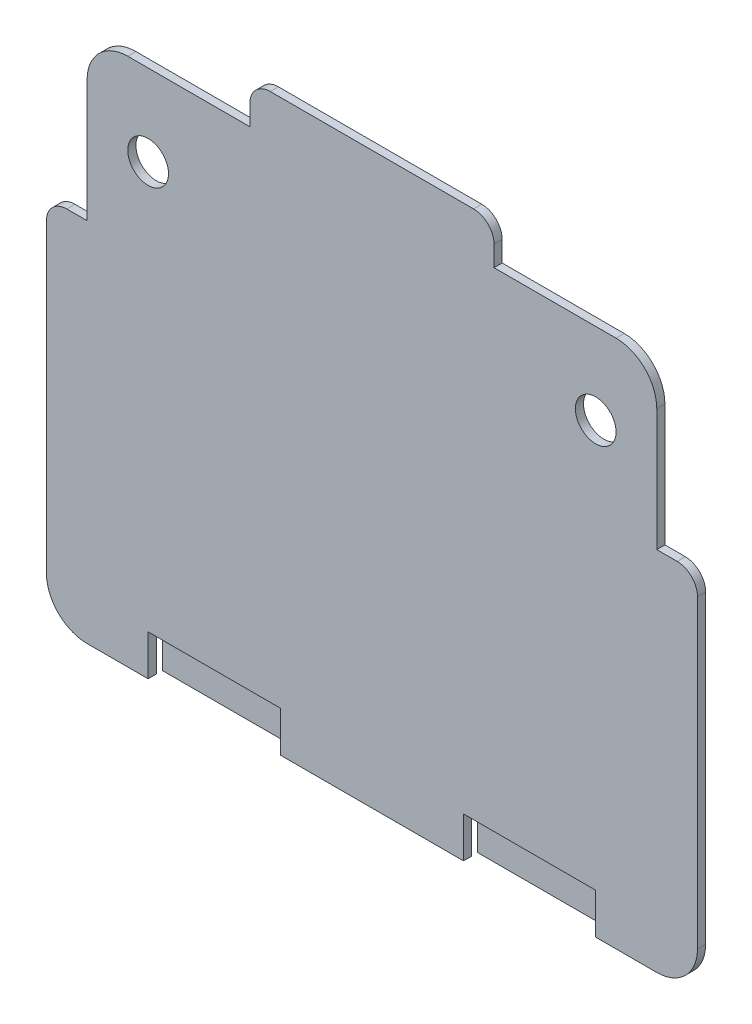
ISO-10303-21;
HEADER;
FILE_DESCRIPTION(('STEP AP214'),'2;1');
FILE_NAME('part.step','',(''),(''),'','','');
FILE_SCHEMA(('AUTOMOTIVE_DESIGN { 1 0 10303 214 1 1 1 1 }'));
ENDSEC;
DATA;
#1=APPLICATION_CONTEXT('core data for automotive mechanical design processes');
#2=APPLICATION_PROTOCOL_DEFINITION('international standard','automotive_design',2000,#1);
#3=PRODUCT_CONTEXT('',#1,'mechanical');
#4=PRODUCT('Part','Part','',(#3));
#5=PRODUCT_RELATED_PRODUCT_CATEGORY('part','',(#4));
#6=PRODUCT_DEFINITION_FORMATION('','',#4);
#7=PRODUCT_DEFINITION_CONTEXT('part definition',#1,'design');
#8=PRODUCT_DEFINITION('design','',#6,#7);
#9=PRODUCT_DEFINITION_SHAPE('','',#8);
#10=(LENGTH_UNIT() NAMED_UNIT(*) SI_UNIT(.MILLI.,.METRE.));
#11=(NAMED_UNIT(*) PLANE_ANGLE_UNIT() SI_UNIT($,.RADIAN.));
#12=(NAMED_UNIT(*) SI_UNIT($,.STERADIAN.) SOLID_ANGLE_UNIT());
#13=UNCERTAINTY_MEASURE_WITH_UNIT(LENGTH_MEASURE(1.E-05),#10,'distance_accuracy_value','');
#14=(GEOMETRIC_REPRESENTATION_CONTEXT(3) GLOBAL_UNCERTAINTY_ASSIGNED_CONTEXT((#13)) GLOBAL_UNIT_ASSIGNED_CONTEXT((#10,
#11,#12)) REPRESENTATION_CONTEXT('',''));
#15=CARTESIAN_POINT('',(0.,0.,0.));
#16=DIRECTION('',(0.,0.,1.));
#17=DIRECTION('',(1.,0.,0.));
#18=AXIS2_PLACEMENT_3D('',#15,#16,#17);
#19=CARTESIAN_POINT('',(0.,0.,0.));
#20=DIRECTION('',(0.,0.,-1.));
#21=DIRECTION('',(-1.,0.,0.));
#22=AXIS2_PLACEMENT_3D('',#19,#20,#21);
#23=PLANE('',#22);
#24=DIRECTION('',(-1.,0.,0.));
#25=VECTOR('',#24,1.);
#26=CARTESIAN_POINT('',(97.4074074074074,53.5185185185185,0.));
#27=LINE('',#26,#25);
#28=CARTESIAN_POINT('',(92.4074074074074,53.5185185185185,0.));
#29=VERTEX_POINT('',#28);
#30=CARTESIAN_POINT('',(87.4074074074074,53.5185185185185,0.));
#31=VERTEX_POINT('',#30);
#32=EDGE_CURVE('E460',#29,#31,#27,.T.);
#33=ORIENTED_EDGE('',*,*,#32,.F.);
#34=CARTESIAN_POINT('',(92.4074074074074,48.5185185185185,0.));
#35=DIRECTION('',(0.,0.,-1.));
#36=DIRECTION('',(-1.,0.,0.));
#37=AXIS2_PLACEMENT_3D('',#34,#35,#36);
#38=CIRCLE('',#37,5.);
#39=CARTESIAN_POINT('',(97.4074074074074,48.5185185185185,0.));
#40=VERTEX_POINT('',#39);
#41=EDGE_CURVE('E554',#29,#40,#38,.T.);
#42=ORIENTED_EDGE('',*,*,#41,.T.);
#43=DIRECTION('',(0.,1.,0.));
#44=VECTOR('',#43,1.);
#45=CARTESIAN_POINT('',(97.4074074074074,-36.4814814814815,0.));
#46=LINE('',#45,#44);
#47=CARTESIAN_POINT('',(97.4074074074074,-26.4814814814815,0.));
#48=VERTEX_POINT('',#47);
#49=EDGE_CURVE('E457',#48,#40,#46,.T.);
#50=ORIENTED_EDGE('',*,*,#49,.F.);
#51=CARTESIAN_POINT('',(87.4074074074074,-26.4814814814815,0.));
#52=DIRECTION('',(0.,0.,-1.));
#53=DIRECTION('',(-1.,0.,0.));
#54=AXIS2_PLACEMENT_3D('',#51,#52,#53);
#55=CIRCLE('',#54,10.);
#56=CARTESIAN_POINT('',(87.4074074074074,-36.4814814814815,0.));
#57=VERTEX_POINT('',#56);
#58=EDGE_CURVE('E521',#48,#57,#55,.T.);
#59=ORIENTED_EDGE('',*,*,#58,.T.);
#60=DIRECTION('',(1.,0.,0.));
#61=VECTOR('',#60,1.);
#62=CARTESIAN_POINT('',(72.4074074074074,-36.4814814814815,0.));
#63=LINE('',#62,#61);
#64=CARTESIAN_POINT('',(72.4074074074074,-36.4814814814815,0.));
#65=VERTEX_POINT('',#64);
#66=EDGE_CURVE('E454',#65,#57,#63,.T.);
#67=ORIENTED_EDGE('',*,*,#66,.F.);
#68=DIRECTION('',(0.,-1.,0.));
#69=VECTOR('',#68,1.);
#70=CARTESIAN_POINT('',(72.4074074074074,-26.4814814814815,0.));
#71=LINE('',#70,#69);
#72=CARTESIAN_POINT('',(72.4074074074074,-26.4814814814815,0.));
#73=VERTEX_POINT('',#72);
#74=EDGE_CURVE('E452',#73,#65,#71,.T.);
#75=ORIENTED_EDGE('',*,*,#74,.F.);
#76=DIRECTION('',(0.,1.,0.));
#77=VECTOR('',#76,1.);
#78=CARTESIAN_POINT('',(72.4074074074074,0.,0.));
#79=LINE('',#78,#77);
#80=CARTESIAN_POINT('',(72.4074074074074,-25.2814814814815,0.));
#81=VERTEX_POINT('',#80);
#82=EDGE_CURVE('E366',#73,#81,#79,.T.);
#83=ORIENTED_EDGE('',*,*,#82,.T.);
#84=DIRECTION('',(-1.,0.,0.));
#85=VECTOR('',#84,1.);
#86=CARTESIAN_POINT('',(0.,-25.2814814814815,0.));
#87=LINE('',#86,#85);
#88=CARTESIAN_POINT('',(39.9074074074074,-25.2814814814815,0.));
#89=VERTEX_POINT('',#88);
#90=EDGE_CURVE('E369',#81,#89,#87,.T.);
#91=ORIENTED_EDGE('',*,*,#90,.T.);
#92=DIRECTION('',(0.,-1.,0.));
#93=VECTOR('',#92,1.);
#94=CARTESIAN_POINT('',(39.9074074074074,0.,0.));
#95=LINE('',#94,#93);
#96=CARTESIAN_POINT('',(39.9074074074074,-26.4814814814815,0.));
#97=VERTEX_POINT('',#96);
#98=EDGE_CURVE('E361',#89,#97,#95,.T.);
#99=ORIENTED_EDGE('',*,*,#98,.T.);
#100=DIRECTION('',(0.,1.,0.));
#101=VECTOR('',#100,1.);
#102=CARTESIAN_POINT('',(39.9074074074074,-36.4814814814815,0.));
#103=LINE('',#102,#101);
#104=CARTESIAN_POINT('',(39.9074074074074,-36.4814814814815,0.));
#105=VERTEX_POINT('',#104);
#106=EDGE_CURVE('E449',#105,#97,#103,.T.);
#107=ORIENTED_EDGE('',*,*,#106,.F.);
#108=DIRECTION('',(1.,0.,0.));
#109=VECTOR('',#108,1.);
#110=CARTESIAN_POINT('',(-5.09259259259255,-36.4814814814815,0.));
#111=LINE('',#110,#109);
#112=CARTESIAN_POINT('',(-5.09259259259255,-36.4814814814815,0.));
#113=VERTEX_POINT('',#112);
#114=EDGE_CURVE('E447',#113,#105,#111,.T.);
#115=ORIENTED_EDGE('',*,*,#114,.F.);
#116=DIRECTION('',(0.,-1.,0.));
#117=VECTOR('',#116,1.);
#118=CARTESIAN_POINT('',(-5.09259259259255,-36.4814814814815,0.));
#119=LINE('',#118,#117);
#120=CARTESIAN_POINT('',(-5.09259259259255,-26.4814814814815,0.));
#121=VERTEX_POINT('',#120);
#122=EDGE_CURVE('E445',#121,#113,#119,.T.);
#123=ORIENTED_EDGE('',*,*,#122,.F.);
#124=DIRECTION('',(0.,1.,0.));
#125=VECTOR('',#124,1.);
#126=CARTESIAN_POINT('',(-5.09259259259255,0.,0.));
#127=LINE('',#126,#125);
#128=CARTESIAN_POINT('',(-5.09259259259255,-25.2814814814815,0.));
#129=VERTEX_POINT('',#128);
#130=EDGE_CURVE('E345',#121,#129,#127,.T.);
#131=ORIENTED_EDGE('',*,*,#130,.T.);
#132=DIRECTION('',(-1.,0.,0.));
#133=VECTOR('',#132,1.);
#134=CARTESIAN_POINT('',(0.,-25.2814814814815,0.));
#135=LINE('',#134,#133);
#136=CARTESIAN_POINT('',(-37.5925925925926,-25.2814814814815,0.));
#137=VERTEX_POINT('',#136);
#138=EDGE_CURVE('E348',#129,#137,#135,.T.);
#139=ORIENTED_EDGE('',*,*,#138,.T.);
#140=DIRECTION('',(0.,-1.,0.));
#141=VECTOR('',#140,1.);
#142=CARTESIAN_POINT('',(-37.5925925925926,0.,0.));
#143=LINE('',#142,#141);
#144=CARTESIAN_POINT('',(-37.5925925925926,-26.4814814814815,0.));
#145=VERTEX_POINT('',#144);
#146=EDGE_CURVE('E340',#137,#145,#143,.T.);
#147=ORIENTED_EDGE('',*,*,#146,.T.);
#148=DIRECTION('',(0.,1.,0.));
#149=VECTOR('',#148,1.);
#150=CARTESIAN_POINT('',(-37.5925925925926,-26.4814814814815,0.));
#151=LINE('',#150,#149);
#152=CARTESIAN_POINT('',(-37.5925925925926,-36.4814814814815,0.));
#153=VERTEX_POINT('',#152);
#154=EDGE_CURVE('E442',#153,#145,#151,.T.);
#155=ORIENTED_EDGE('',*,*,#154,.F.);
#156=DIRECTION('',(1.,0.,0.));
#157=VECTOR('',#156,1.);
#158=CARTESIAN_POINT('',(-37.5925925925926,-36.4814814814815,0.));
#159=LINE('',#158,#157);
#160=CARTESIAN_POINT('',(-52.5925925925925,-36.4814814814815,0.));
#161=VERTEX_POINT('',#160);
#162=EDGE_CURVE('E440',#161,#153,#159,.T.);
#163=ORIENTED_EDGE('',*,*,#162,.F.);
#164=CARTESIAN_POINT('',(-52.5925925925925,-26.4814814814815,0.));
#165=DIRECTION('',(0.,0.,-1.));
#166=DIRECTION('',(-1.,0.,0.));
#167=AXIS2_PLACEMENT_3D('',#164,#165,#166);
#168=CIRCLE('',#167,10.);
#169=CARTESIAN_POINT('',(-62.5925925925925,-26.4814814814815,0.));
#170=VERTEX_POINT('',#169);
#171=EDGE_CURVE('E523',#161,#170,#168,.T.);
#172=ORIENTED_EDGE('',*,*,#171,.T.);
#173=DIRECTION('',(0.,-1.,0.));
#174=VECTOR('',#173,1.);
#175=CARTESIAN_POINT('',(-62.5925925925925,-36.4814814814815,0.));
#176=LINE('',#175,#174);
#177=CARTESIAN_POINT('',(-62.5925925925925,48.5185185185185,0.));
#178=VERTEX_POINT('',#177);
#179=EDGE_CURVE('E438',#178,#170,#176,.T.);
#180=ORIENTED_EDGE('',*,*,#179,.F.);
#181=CARTESIAN_POINT('',(-57.5925925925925,48.5185185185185,0.));
#182=DIRECTION('',(0.,0.,-1.));
#183=DIRECTION('',(-1.,0.,0.));
#184=AXIS2_PLACEMENT_3D('',#181,#182,#183);
#185=CIRCLE('',#184,5.);
#186=CARTESIAN_POINT('',(-57.5925925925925,53.5185185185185,0.));
#187=VERTEX_POINT('',#186);
#188=EDGE_CURVE('E548',#178,#187,#185,.T.);
#189=ORIENTED_EDGE('',*,*,#188,.T.);
#190=DIRECTION('',(-1.,0.,0.));
#191=VECTOR('',#190,1.);
#192=CARTESIAN_POINT('',(-62.5925925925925,53.5185185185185,0.));
#193=LINE('',#192,#191);
#194=CARTESIAN_POINT('',(-52.5925925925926,53.5185185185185,0.));
#195=VERTEX_POINT('',#194);
#196=EDGE_CURVE('E436',#195,#187,#193,.T.);
#197=ORIENTED_EDGE('',*,*,#196,.F.);
#198=DIRECTION('',(0.,-1.,0.));
#199=VECTOR('',#198,1.);
#200=CARTESIAN_POINT('',(-52.5925925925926,53.5185185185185,0.));
#201=LINE('',#200,#199);
#202=CARTESIAN_POINT('',(-52.5925925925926,83.5185185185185,0.));
#203=VERTEX_POINT('',#202);
#204=EDGE_CURVE('E434',#203,#195,#201,.T.);
#205=ORIENTED_EDGE('',*,*,#204,.F.);
#206=CARTESIAN_POINT('',(-42.5925925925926,83.5185185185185,0.));
#207=DIRECTION('',(0.,0.,-1.));
#208=DIRECTION('',(-1.,0.,0.));
#209=AXIS2_PLACEMENT_3D('',#206,#207,#208);
#210=CIRCLE('',#209,10.);
#211=CARTESIAN_POINT('',(-42.5925925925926,93.5185185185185,0.));
#212=VERTEX_POINT('',#211);
#213=EDGE_CURVE('E510',#203,#212,#210,.T.);
#214=ORIENTED_EDGE('',*,*,#213,.T.);
#215=DIRECTION('',(-1.,0.,0.));
#216=VECTOR('',#215,1.);
#217=CARTESIAN_POINT('',(-52.5925925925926,93.5185185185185,0.));
#218=LINE('',#217,#216);
#219=CARTESIAN_POINT('',(-12.5925925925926,93.5185185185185,0.));
#220=VERTEX_POINT('',#219);
#221=EDGE_CURVE('E431',#220,#212,#218,.T.);
#222=ORIENTED_EDGE('',*,*,#221,.F.);
#223=DIRECTION('',(0.,-1.,0.));
#224=VECTOR('',#223,1.);
#225=CARTESIAN_POINT('',(-12.5925925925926,93.5185185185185,0.));
#226=LINE('',#225,#224);
#227=CARTESIAN_POINT('',(-12.5925925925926,98.5185185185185,0.));
#228=VERTEX_POINT('',#227);
#229=EDGE_CURVE('E382',#228,#220,#226,.T.);
#230=ORIENTED_EDGE('',*,*,#229,.F.);
#231=CARTESIAN_POINT('',(-7.59259259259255,98.5185185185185,0.));
#232=DIRECTION('',(0.,0.,-1.));
#233=DIRECTION('',(-1.,0.,0.));
#234=AXIS2_PLACEMENT_3D('',#231,#232,#233);
#235=CIRCLE('',#234,5.);
#236=CARTESIAN_POINT('',(-7.59259259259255,103.518518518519,0.));
#237=VERTEX_POINT('',#236);
#238=EDGE_CURVE('E550',#228,#237,#235,.T.);
#239=ORIENTED_EDGE('',*,*,#238,.T.);
#240=DIRECTION('',(-1.,0.,0.));
#241=VECTOR('',#240,1.);
#242=CARTESIAN_POINT('',(-12.5925925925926,103.518518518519,0.));
#243=LINE('',#242,#241);
#244=CARTESIAN_POINT('',(42.4074074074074,103.518518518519,0.));
#245=VERTEX_POINT('',#244);
#246=EDGE_CURVE('E386',#245,#237,#243,.T.);
#247=ORIENTED_EDGE('',*,*,#246,.F.);
#248=CARTESIAN_POINT('',(42.4074074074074,98.5185185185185,0.));
#249=DIRECTION('',(0.,0.,-1.));
#250=DIRECTION('',(-1.,0.,0.));
#251=AXIS2_PLACEMENT_3D('',#248,#249,#250);
#252=CIRCLE('',#251,5.);
#253=CARTESIAN_POINT('',(47.4074074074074,98.5185185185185,0.));
#254=VERTEX_POINT('',#253);
#255=EDGE_CURVE('E552',#245,#254,#252,.T.);
#256=ORIENTED_EDGE('',*,*,#255,.T.);
#257=DIRECTION('',(0.,1.,0.));
#258=VECTOR('',#257,1.);
#259=CARTESIAN_POINT('',(47.4074074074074,93.5185185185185,0.));
#260=LINE('',#259,#258);
#261=CARTESIAN_POINT('',(47.4074074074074,93.5185185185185,0.));
#262=VERTEX_POINT('',#261);
#263=EDGE_CURVE('E467',#262,#254,#260,.T.);
#264=ORIENTED_EDGE('',*,*,#263,.F.);
#265=DIRECTION('',(-1.,0.,0.));
#266=VECTOR('',#265,1.);
#267=CARTESIAN_POINT('',(87.4074074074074,93.5185185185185,0.));
#268=LINE('',#267,#266);
#269=CARTESIAN_POINT('',(77.4074074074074,93.5185185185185,0.));
#270=VERTEX_POINT('',#269);
#271=EDGE_CURVE('E465',#270,#262,#268,.T.);
#272=ORIENTED_EDGE('',*,*,#271,.F.);
#273=CARTESIAN_POINT('',(77.4074074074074,83.5185185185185,0.));
#274=DIRECTION('',(0.,0.,-1.));
#275=DIRECTION('',(-1.,0.,0.));
#276=AXIS2_PLACEMENT_3D('',#273,#274,#275);
#277=CIRCLE('',#276,10.);
#278=CARTESIAN_POINT('',(87.4074074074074,83.5185185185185,0.));
#279=VERTEX_POINT('',#278);
#280=EDGE_CURVE('E519',#270,#279,#277,.T.);
#281=ORIENTED_EDGE('',*,*,#280,.T.);
#282=DIRECTION('',(0.,1.,0.));
#283=VECTOR('',#282,1.);
#284=CARTESIAN_POINT('',(87.4074074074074,53.5185185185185,0.));
#285=LINE('',#284,#283);
#286=EDGE_CURVE('E462',#31,#279,#285,.T.);
#287=ORIENTED_EDGE('',*,*,#286,.F.);
#288=EDGE_LOOP('',(#33,#42,#50,#59,#67,#75,#83,#91,#99,#107,#115,#123,#131,#139,#147,#155,#163,
#172,#180,#189,#197,#205,#214,#222,#230,#239,#247,#256,#264,#272,#281,#287));
#289=FACE_BOUND('',#288,.T.);
#290=CARTESIAN_POINT('',(72.4074074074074,73.5185185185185,0.));
#291=DIRECTION('',(0.,0.,-1.));
#292=DIRECTION('',(-1.,0.,0.));
#293=AXIS2_PLACEMENT_3D('',#290,#291,#292);
#294=CIRCLE('',#293,5.00000000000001);
#295=CARTESIAN_POINT('',(67.4074074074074,73.5185185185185,0.));
#296=VERTEX_POINT('',#295);
#297=EDGE_CURVE('E1164',#296,#296,#294,.T.);
#298=ORIENTED_EDGE('',*,*,#297,.F.);
#299=EDGE_LOOP('',(#298));
#300=FACE_BOUND('',#299,.T.);
#301=CARTESIAN_POINT('',(-37.5925925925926,73.5185185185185,0.));
#302=DIRECTION('',(0.,0.,-1.));
#303=DIRECTION('',(-1.,0.,0.));
#304=AXIS2_PLACEMENT_3D('',#301,#302,#303);
#305=CIRCLE('',#304,5.00000000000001);
#306=CARTESIAN_POINT('',(-42.5925925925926,73.5185185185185,0.));
#307=VERTEX_POINT('',#306);
#308=EDGE_CURVE('E1161',#307,#307,#305,.F.);
#309=ORIENTED_EDGE('',*,*,#308,.T.);
#310=EDGE_LOOP('',(#309));
#311=FACE_BOUND('',#310,.T.);
#312=ADVANCED_FACE('F40',(#289,#300,#311),#23,.T.);
#313=CARTESIAN_POINT('',(0.,0.,2.));
#314=DIRECTION('',(0.,0.,-1.));
#315=DIRECTION('',(-1.,0.,0.));
#316=AXIS2_PLACEMENT_3D('',#313,#314,#315);
#317=PLANE('',#316);
#318=CARTESIAN_POINT('',(72.4074074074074,73.5185185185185,2.));
#319=DIRECTION('',(0.,0.,1.));
#320=DIRECTION('',(1.,0.,0.));
#321=AXIS2_PLACEMENT_3D('',#318,#319,#320);
#322=CIRCLE('',#321,5.00000000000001);
#323=CARTESIAN_POINT('',(77.4074074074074,73.5185185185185,2.));
#324=VERTEX_POINT('',#323);
#325=EDGE_CURVE('E1172',#324,#324,#322,.T.);
#326=ORIENTED_EDGE('',*,*,#325,.F.);
#327=EDGE_LOOP('',(#326));
#328=FACE_BOUND('',#327,.T.);
#329=DIRECTION('',(0.,1.,0.));
#330=VECTOR('',#329,1.);
#331=CARTESIAN_POINT('',(97.4074074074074,-36.4814814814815,2.));
#332=LINE('',#331,#330);
#333=CARTESIAN_POINT('',(97.4074074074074,-26.4814814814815,2.));
#334=VERTEX_POINT('',#333);
#335=CARTESIAN_POINT('',(97.4074074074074,48.5185185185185,2.));
#336=VERTEX_POINT('',#335);
#337=EDGE_CURVE('E414',#334,#336,#332,.T.);
#338=ORIENTED_EDGE('',*,*,#337,.T.);
#339=CARTESIAN_POINT('',(92.4074074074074,48.5185185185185,2.));
#340=DIRECTION('',(0.,0.,-1.));
#341=DIRECTION('',(-1.,0.,0.));
#342=AXIS2_PLACEMENT_3D('',#339,#340,#341);
#343=CIRCLE('',#342,5.);
#344=CARTESIAN_POINT('',(92.4074074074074,53.5185185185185,2.));
#345=VERTEX_POINT('',#344);
#346=EDGE_CURVE('E563',#336,#345,#343,.F.);
#347=ORIENTED_EDGE('',*,*,#346,.T.);
#348=DIRECTION('',(-1.,0.,0.));
#349=VECTOR('',#348,1.);
#350=CARTESIAN_POINT('',(97.4074074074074,53.5185185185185,2.));
#351=LINE('',#350,#349);
#352=CARTESIAN_POINT('',(87.4074074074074,53.5185185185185,2.));
#353=VERTEX_POINT('',#352);
#354=EDGE_CURVE('E417',#345,#353,#351,.T.);
#355=ORIENTED_EDGE('',*,*,#354,.T.);
#356=DIRECTION('',(0.,1.,0.));
#357=VECTOR('',#356,1.);
#358=CARTESIAN_POINT('',(87.4074074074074,53.5185185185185,2.));
#359=LINE('',#358,#357);
#360=CARTESIAN_POINT('',(87.4074074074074,83.5185185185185,2.));
#361=VERTEX_POINT('',#360);
#362=EDGE_CURVE('E419',#353,#361,#359,.T.);
#363=ORIENTED_EDGE('',*,*,#362,.T.);
#364=CARTESIAN_POINT('',(77.4074074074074,83.5185185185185,2.));
#365=DIRECTION('',(0.,0.,-1.));
#366=DIRECTION('',(-1.,0.,0.));
#367=AXIS2_PLACEMENT_3D('',#364,#365,#366);
#368=CIRCLE('',#367,10.);
#369=CARTESIAN_POINT('',(77.4074074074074,93.5185185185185,2.));
#370=VERTEX_POINT('',#369);
#371=EDGE_CURVE('E529',#361,#370,#368,.F.);
#372=ORIENTED_EDGE('',*,*,#371,.T.);
#373=DIRECTION('',(-1.,0.,0.));
#374=VECTOR('',#373,1.);
#375=CARTESIAN_POINT('',(87.4074074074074,93.5185185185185,2.));
#376=LINE('',#375,#374);
#377=CARTESIAN_POINT('',(47.4074074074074,93.5185185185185,2.));
#378=VERTEX_POINT('',#377);
#379=EDGE_CURVE('E422',#370,#378,#376,.T.);
#380=ORIENTED_EDGE('',*,*,#379,.T.);
#381=DIRECTION('',(0.,1.,0.));
#382=VECTOR('',#381,1.);
#383=CARTESIAN_POINT('',(47.4074074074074,93.5185185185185,2.));
#384=LINE('',#383,#382);
#385=CARTESIAN_POINT('',(47.4074074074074,98.5185185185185,2.));
#386=VERTEX_POINT('',#385);
#387=EDGE_CURVE('E424',#378,#386,#384,.T.);
#388=ORIENTED_EDGE('',*,*,#387,.T.);
#389=CARTESIAN_POINT('',(42.4074074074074,98.5185185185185,2.));
#390=DIRECTION('',(0.,0.,-1.));
#391=DIRECTION('',(-1.,0.,0.));
#392=AXIS2_PLACEMENT_3D('',#389,#390,#391);
#393=CIRCLE('',#392,5.);
#394=CARTESIAN_POINT('',(42.4074074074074,103.518518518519,2.));
#395=VERTEX_POINT('',#394);
#396=EDGE_CURVE('E561',#386,#395,#393,.F.);
#397=ORIENTED_EDGE('',*,*,#396,.T.);
#398=DIRECTION('',(-1.,0.,0.));
#399=VECTOR('',#398,1.);
#400=CARTESIAN_POINT('',(-12.5925925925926,103.518518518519,2.));
#401=LINE('',#400,#399);
#402=CARTESIAN_POINT('',(-7.59259259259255,103.518518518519,2.));
#403=VERTEX_POINT('',#402);
#404=EDGE_CURVE('E427',#395,#403,#401,.T.);
#405=ORIENTED_EDGE('',*,*,#404,.T.);
#406=CARTESIAN_POINT('',(-7.59259259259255,98.5185185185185,2.));
#407=DIRECTION('',(0.,0.,-1.));
#408=DIRECTION('',(-1.,0.,0.));
#409=AXIS2_PLACEMENT_3D('',#406,#407,#408);
#410=CIRCLE('',#409,5.);
#411=CARTESIAN_POINT('',(-12.5925925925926,98.5185185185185,2.));
#412=VERTEX_POINT('',#411);
#413=EDGE_CURVE('E61',#403,#412,#410,.F.);
#414=ORIENTED_EDGE('',*,*,#413,.T.);
#415=DIRECTION('',(0.,-1.,0.));
#416=VECTOR('',#415,1.);
#417=CARTESIAN_POINT('',(-12.5925925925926,93.5185185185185,2.));
#418=LINE('',#417,#416);
#419=CARTESIAN_POINT('',(-12.5925925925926,93.5185185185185,2.));
#420=VERTEX_POINT('',#419);
#421=EDGE_CURVE('E383',#412,#420,#418,.T.);
#422=ORIENTED_EDGE('',*,*,#421,.T.);
#423=DIRECTION('',(-1.,0.,0.));
#424=VECTOR('',#423,1.);
#425=CARTESIAN_POINT('',(-52.5925925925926,93.5185185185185,2.));
#426=LINE('',#425,#424);
#427=CARTESIAN_POINT('',(-42.5925925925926,93.5185185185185,2.));
#428=VERTEX_POINT('',#427);
#429=EDGE_CURVE('E385',#420,#428,#426,.T.);
#430=ORIENTED_EDGE('',*,*,#429,.T.);
#431=CARTESIAN_POINT('',(-42.5925925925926,83.5185185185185,2.));
#432=DIRECTION('',(0.,0.,-1.));
#433=DIRECTION('',(-1.,0.,0.));
#434=AXIS2_PLACEMENT_3D('',#431,#432,#433);
#435=CIRCLE('',#434,10.);
#436=CARTESIAN_POINT('',(-52.5925925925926,83.5185185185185,2.));
#437=VERTEX_POINT('',#436);
#438=EDGE_CURVE('E514',#428,#437,#435,.F.);
#439=ORIENTED_EDGE('',*,*,#438,.T.);
#440=DIRECTION('',(0.,-1.,0.));
#441=VECTOR('',#440,1.);
#442=CARTESIAN_POINT('',(-52.5925925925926,53.5185185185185,2.));
#443=LINE('',#442,#441);
#444=CARTESIAN_POINT('',(-52.5925925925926,53.5185185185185,2.));
#445=VERTEX_POINT('',#444);
#446=EDGE_CURVE('E389',#437,#445,#443,.T.);
#447=ORIENTED_EDGE('',*,*,#446,.T.);
#448=DIRECTION('',(-1.,0.,0.));
#449=VECTOR('',#448,1.);
#450=CARTESIAN_POINT('',(-62.5925925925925,53.5185185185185,2.));
#451=LINE('',#450,#449);
#452=CARTESIAN_POINT('',(-57.5925925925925,53.5185185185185,2.));
#453=VERTEX_POINT('',#452);
#454=EDGE_CURVE('E391',#445,#453,#451,.T.);
#455=ORIENTED_EDGE('',*,*,#454,.T.);
#456=CARTESIAN_POINT('',(-57.5925925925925,48.5185185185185,2.));
#457=DIRECTION('',(0.,0.,-1.));
#458=DIRECTION('',(-1.,0.,0.));
#459=AXIS2_PLACEMENT_3D('',#456,#457,#458);
#460=CIRCLE('',#459,5.);
#461=CARTESIAN_POINT('',(-62.5925925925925,48.5185185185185,2.));
#462=VERTEX_POINT('',#461);
#463=EDGE_CURVE('E558',#453,#462,#460,.F.);
#464=ORIENTED_EDGE('',*,*,#463,.T.);
#465=DIRECTION('',(0.,-1.,0.));
#466=VECTOR('',#465,1.);
#467=CARTESIAN_POINT('',(-62.5925925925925,-36.4814814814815,2.));
#468=LINE('',#467,#466);
#469=CARTESIAN_POINT('',(-62.5925925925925,-26.4814814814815,2.));
#470=VERTEX_POINT('',#469);
#471=EDGE_CURVE('E393',#462,#470,#468,.T.);
#472=ORIENTED_EDGE('',*,*,#471,.T.);
#473=CARTESIAN_POINT('',(-52.5925925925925,-26.4814814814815,2.));
#474=DIRECTION('',(0.,0.,-1.));
#475=DIRECTION('',(-1.,0.,0.));
#476=AXIS2_PLACEMENT_3D('',#473,#474,#475);
#477=CIRCLE('',#476,10.);
#478=CARTESIAN_POINT('',(-52.5925925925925,-36.4814814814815,2.));
#479=VERTEX_POINT('',#478);
#480=EDGE_CURVE('E533',#470,#479,#477,.F.);
#481=ORIENTED_EDGE('',*,*,#480,.T.);
#482=DIRECTION('',(1.,0.,0.));
#483=VECTOR('',#482,1.);
#484=CARTESIAN_POINT('',(-37.5925925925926,-36.4814814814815,2.));
#485=LINE('',#484,#483);
#486=CARTESIAN_POINT('',(-37.5925925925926,-36.4814814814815,2.));
#487=VERTEX_POINT('',#486);
#488=EDGE_CURVE('E395',#479,#487,#485,.T.);
#489=ORIENTED_EDGE('',*,*,#488,.T.);
#490=DIRECTION('',(0.,1.,0.));
#491=VECTOR('',#490,1.);
#492=CARTESIAN_POINT('',(-37.5925925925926,-26.4814814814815,2.));
#493=LINE('',#492,#491);
#494=CARTESIAN_POINT('',(-37.5925925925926,-26.4814814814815,2.));
#495=VERTEX_POINT('',#494);
#496=EDGE_CURVE('E397',#487,#495,#493,.T.);
#497=ORIENTED_EDGE('',*,*,#496,.T.);
#498=DIRECTION('',(1.,0.,0.));
#499=VECTOR('',#498,1.);
#500=CARTESIAN_POINT('',(-5.09259259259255,-26.4814814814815,2.));
#501=LINE('',#500,#499);
#502=CARTESIAN_POINT('',(-5.09259259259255,-26.4814814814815,2.));
#503=VERTEX_POINT('',#502);
#504=EDGE_CURVE('E399',#495,#503,#501,.T.);
#505=ORIENTED_EDGE('',*,*,#504,.T.);
#506=DIRECTION('',(0.,-1.,0.));
#507=VECTOR('',#506,1.);
#508=CARTESIAN_POINT('',(-5.09259259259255,-36.4814814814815,2.));
#509=LINE('',#508,#507);
#510=CARTESIAN_POINT('',(-5.09259259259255,-36.4814814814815,2.));
#511=VERTEX_POINT('',#510);
#512=EDGE_CURVE('E401',#503,#511,#509,.T.);
#513=ORIENTED_EDGE('',*,*,#512,.T.);
#514=DIRECTION('',(1.,0.,0.));
#515=VECTOR('',#514,1.);
#516=CARTESIAN_POINT('',(-5.09259259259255,-36.4814814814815,2.));
#517=LINE('',#516,#515);
#518=CARTESIAN_POINT('',(39.9074074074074,-36.4814814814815,2.));
#519=VERTEX_POINT('',#518);
#520=EDGE_CURVE('E403',#511,#519,#517,.T.);
#521=ORIENTED_EDGE('',*,*,#520,.T.);
#522=DIRECTION('',(0.,1.,0.));
#523=VECTOR('',#522,1.);
#524=CARTESIAN_POINT('',(39.9074074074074,-36.4814814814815,2.));
#525=LINE('',#524,#523);
#526=CARTESIAN_POINT('',(39.9074074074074,-26.4814814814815,2.));
#527=VERTEX_POINT('',#526);
#528=EDGE_CURVE('E405',#519,#527,#525,.T.);
#529=ORIENTED_EDGE('',*,*,#528,.T.);
#530=DIRECTION('',(1.,0.,0.));
#531=VECTOR('',#530,1.);
#532=CARTESIAN_POINT('',(39.9074074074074,-26.4814814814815,2.));
#533=LINE('',#532,#531);
#534=CARTESIAN_POINT('',(72.4074074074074,-26.4814814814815,2.));
#535=VERTEX_POINT('',#534);
#536=EDGE_CURVE('E407',#527,#535,#533,.T.);
#537=ORIENTED_EDGE('',*,*,#536,.T.);
#538=DIRECTION('',(0.,-1.,0.));
#539=VECTOR('',#538,1.);
#540=CARTESIAN_POINT('',(72.4074074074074,-26.4814814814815,2.));
#541=LINE('',#540,#539);
#542=CARTESIAN_POINT('',(72.4074074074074,-36.4814814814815,2.));
#543=VERTEX_POINT('',#542);
#544=EDGE_CURVE('E409',#535,#543,#541,.T.);
#545=ORIENTED_EDGE('',*,*,#544,.T.);
#546=DIRECTION('',(1.,0.,0.));
#547=VECTOR('',#546,1.);
#548=CARTESIAN_POINT('',(72.4074074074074,-36.4814814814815,2.));
#549=LINE('',#548,#547);
#550=CARTESIAN_POINT('',(87.4074074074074,-36.4814814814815,2.));
#551=VERTEX_POINT('',#550);
#552=EDGE_CURVE('E411',#543,#551,#549,.T.);
#553=ORIENTED_EDGE('',*,*,#552,.T.);
#554=CARTESIAN_POINT('',(87.4074074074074,-26.4814814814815,2.));
#555=DIRECTION('',(0.,0.,-1.));
#556=DIRECTION('',(-1.,0.,0.));
#557=AXIS2_PLACEMENT_3D('',#554,#555,#556);
#558=CIRCLE('',#557,10.);
#559=EDGE_CURVE('E531',#551,#334,#558,.F.);
#560=ORIENTED_EDGE('',*,*,#559,.T.);
#561=EDGE_LOOP('',(#338,#347,#355,#363,#372,#380,#388,#397,#405,#414,#422,#430,#439,#447,#455,
#464,#472,#481,#489,#497,#505,#513,#521,#529,#537,#545,#553,#560));
#562=FACE_BOUND('',#561,.T.);
#563=CARTESIAN_POINT('',(-37.5925925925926,73.5185185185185,2.));
#564=DIRECTION('',(0.,0.,1.));
#565=DIRECTION('',(1.,0.,0.));
#566=AXIS2_PLACEMENT_3D('',#563,#564,#565);
#567=CIRCLE('',#566,5.00000000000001);
#568=CARTESIAN_POINT('',(-32.5925925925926,73.5185185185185,2.));
#569=VERTEX_POINT('',#568);
#570=EDGE_CURVE('E1169',#569,#569,#567,.F.);
#571=ORIENTED_EDGE('',*,*,#570,.T.);
#572=EDGE_LOOP('',(#571));
#573=FACE_BOUND('',#572,.T.);
#574=ADVANCED_FACE('F594',(#328,#562,#573),#317,.F.);
#575=CARTESIAN_POINT('',(-12.5925925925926,93.5185185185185,2.));
#576=DIRECTION('',(1.,0.,0.));
#577=DIRECTION('',(0.,0.,-1.));
#578=AXIS2_PLACEMENT_3D('',#575,#576,#577);
#579=PLANE('',#578);
#580=ORIENTED_EDGE('',*,*,#421,.F.);
#581=DIRECTION('',(0.,0.,-1.));
#582=VECTOR('',#581,1.);
#583=CARTESIAN_POINT('',(-12.5925925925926,98.5185185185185,2.));
#584=LINE('',#583,#582);
#585=EDGE_CURVE('E572',#412,#228,#584,.T.);
#586=ORIENTED_EDGE('',*,*,#585,.T.);
#587=ORIENTED_EDGE('',*,*,#229,.T.);
#588=DIRECTION('',(0.,0.,-1.));
#589=VECTOR('',#588,1.);
#590=CARTESIAN_POINT('',(-12.5925925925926,93.5185185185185,2.));
#591=LINE('',#590,#589);
#592=EDGE_CURVE('E504',#420,#220,#591,.T.);
#593=ORIENTED_EDGE('',*,*,#592,.F.);
#594=EDGE_LOOP('',(#580,#586,#587,#593));
#595=FACE_BOUND('',#594,.T.);
#596=ADVANCED_FACE('F686',(#595),#579,.F.);
#597=CARTESIAN_POINT('',(-52.5925925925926,93.5185185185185,2.));
#598=DIRECTION('',(0.,-1.,0.));
#599=DIRECTION('',(1.,0.,0.));
#600=AXIS2_PLACEMENT_3D('',#597,#598,#599);
#601=PLANE('',#600);
#602=ORIENTED_EDGE('',*,*,#221,.T.);
#603=DIRECTION('',(0.,0.,-1.));
#604=VECTOR('',#603,1.);
#605=CARTESIAN_POINT('',(-42.5925925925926,93.5185185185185,2.));
#606=LINE('',#605,#604);
#607=EDGE_CURVE('E512',#212,#428,#606,.F.);
#608=ORIENTED_EDGE('',*,*,#607,.T.);
#609=ORIENTED_EDGE('',*,*,#429,.F.);
#610=ORIENTED_EDGE('',*,*,#592,.T.);
#611=EDGE_LOOP('',(#602,#608,#609,#610));
#612=FACE_BOUND('',#611,.T.);
#613=ADVANCED_FACE('F693',(#612),#601,.F.);
#614=CARTESIAN_POINT('',(-52.5925925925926,53.5185185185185,2.));
#615=DIRECTION('',(1.,0.,0.));
#616=DIRECTION('',(0.,0.,-1.));
#617=AXIS2_PLACEMENT_3D('',#614,#615,#616);
#618=PLANE('',#617);
#619=ORIENTED_EDGE('',*,*,#446,.F.);
#620=DIRECTION('',(0.,0.,-1.));
#621=VECTOR('',#620,1.);
#622=CARTESIAN_POINT('',(-52.5925925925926,83.5185185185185,2.));
#623=LINE('',#622,#621);
#624=EDGE_CURVE('E507',#437,#203,#623,.T.);
#625=ORIENTED_EDGE('',*,*,#624,.T.);
#626=ORIENTED_EDGE('',*,*,#204,.T.);
#627=DIRECTION('',(0.,0.,-1.));
#628=VECTOR('',#627,1.);
#629=CARTESIAN_POINT('',(-52.5925925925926,53.5185185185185,2.));
#630=LINE('',#629,#628);
#631=EDGE_CURVE('E501',#445,#195,#630,.T.);
#632=ORIENTED_EDGE('',*,*,#631,.F.);
#633=EDGE_LOOP('',(#619,#625,#626,#632));
#634=FACE_BOUND('',#633,.T.);
#635=ADVANCED_FACE('F700',(#634),#618,.F.);
#636=CARTESIAN_POINT('',(-62.5925925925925,53.5185185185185,2.));
#637=DIRECTION('',(0.,-1.,0.));
#638=DIRECTION('',(0.,0.,-1.));
#639=AXIS2_PLACEMENT_3D('',#636,#637,#638);
#640=PLANE('',#639);
#641=ORIENTED_EDGE('',*,*,#196,.T.);
#642=DIRECTION('',(0.,0.,-1.));
#643=VECTOR('',#642,1.);
#644=CARTESIAN_POINT('',(-57.5925925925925,53.5185185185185,2.));
#645=LINE('',#644,#643);
#646=EDGE_CURVE('E11',#187,#453,#645,.F.);
#647=ORIENTED_EDGE('',*,*,#646,.T.);
#648=ORIENTED_EDGE('',*,*,#454,.F.);
#649=ORIENTED_EDGE('',*,*,#631,.T.);
#650=EDGE_LOOP('',(#641,#647,#648,#649));
#651=FACE_BOUND('',#650,.T.);
#652=ADVANCED_FACE('F702',(#651),#640,.F.);
#653=CARTESIAN_POINT('',(-62.5925925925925,-36.4814814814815,2.));
#654=DIRECTION('',(1.,0.,0.));
#655=DIRECTION('',(0.,0.,-1.));
#656=AXIS2_PLACEMENT_3D('',#653,#654,#655);
#657=PLANE('',#656);
#658=ORIENTED_EDGE('',*,*,#471,.F.);
#659=DIRECTION('',(0.,0.,-1.));
#660=VECTOR('',#659,1.);
#661=CARTESIAN_POINT('',(-62.5925925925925,48.5185185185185,2.));
#662=LINE('',#661,#660);
#663=EDGE_CURVE('E48',#462,#178,#662,.T.);
#664=ORIENTED_EDGE('',*,*,#663,.T.);
#665=ORIENTED_EDGE('',*,*,#179,.T.);
#666=DIRECTION('',(0.,0.,-1.));
#667=VECTOR('',#666,1.);
#668=CARTESIAN_POINT('',(-62.5925925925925,-26.4814814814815,2.));
#669=LINE('',#668,#667);
#670=EDGE_CURVE('E526',#170,#470,#669,.F.);
#671=ORIENTED_EDGE('',*,*,#670,.T.);
#672=EDGE_LOOP('',(#658,#664,#665,#671));
#673=FACE_BOUND('',#672,.T.);
#674=ADVANCED_FACE('F579',(#673),#657,.F.);
#675=CARTESIAN_POINT('',(-37.5925925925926,-36.4814814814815,2.));
#676=DIRECTION('',(0.,1.,0.));
#677=DIRECTION('',(0.,0.,1.));
#678=AXIS2_PLACEMENT_3D('',#675,#676,#677);
#679=PLANE('',#678);
#680=ORIENTED_EDGE('',*,*,#488,.F.);
#681=DIRECTION('',(0.,0.,-1.));
#682=VECTOR('',#681,1.);
#683=CARTESIAN_POINT('',(-52.5925925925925,-36.4814814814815,2.));
#684=LINE('',#683,#682);
#685=EDGE_CURVE('E516',#479,#161,#684,.T.);
#686=ORIENTED_EDGE('',*,*,#685,.T.);
#687=ORIENTED_EDGE('',*,*,#162,.T.);
#688=DIRECTION('',(0.,0.,-1.));
#689=VECTOR('',#688,1.);
#690=CARTESIAN_POINT('',(-37.5925925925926,-36.4814814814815,2.));
#691=LINE('',#690,#689);
#692=EDGE_CURVE('E498',#487,#153,#691,.T.);
#693=ORIENTED_EDGE('',*,*,#692,.F.);
#694=EDGE_LOOP('',(#680,#686,#687,#693));
#695=FACE_BOUND('',#694,.T.);
#696=ADVANCED_FACE('F598',(#695),#679,.F.);
#697=CARTESIAN_POINT('',(-37.5925925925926,-26.4814814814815,2.));
#698=DIRECTION('',(-1.,0.,0.));
#699=DIRECTION('',(0.,0.,1.));
#700=AXIS2_PLACEMENT_3D('',#697,#698,#699);
#701=PLANE('',#700);
#702=ORIENTED_EDGE('',*,*,#154,.T.);
#703=DIRECTION('',(0.,0.,-1.));
#704=VECTOR('',#703,1.);
#705=CARTESIAN_POINT('',(-37.5925925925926,-26.4814814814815,2.));
#706=LINE('',#705,#704);
#707=EDGE_CURVE('E495',#495,#145,#706,.T.);
#708=ORIENTED_EDGE('',*,*,#707,.F.);
#709=ORIENTED_EDGE('',*,*,#496,.F.);
#710=ORIENTED_EDGE('',*,*,#692,.T.);
#711=EDGE_LOOP('',(#702,#708,#709,#710));
#712=FACE_BOUND('',#711,.T.);
#713=ADVANCED_FACE('F602',(#712),#701,.F.);
#714=CARTESIAN_POINT('',(-5.09259259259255,-26.4814814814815,2.));
#715=DIRECTION('',(0.,1.,0.));
#716=DIRECTION('',(0.,0.,1.));
#717=AXIS2_PLACEMENT_3D('',#714,#715,#716);
#718=PLANE('',#717);
#719=ORIENTED_EDGE('',*,*,#707,.T.);
#720=DIRECTION('',(0.,0.,1.));
#721=VECTOR('',#720,1.);
#722=CARTESIAN_POINT('',(-37.5925925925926,-26.4814814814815,-1.5));
#723=LINE('',#722,#721);
#724=CARTESIAN_POINT('',(-37.5925925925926,-26.4814814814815,-1.5));
#725=VERTEX_POINT('',#724);
#726=EDGE_CURVE('E344',#725,#145,#723,.T.);
#727=ORIENTED_EDGE('',*,*,#726,.F.);
#728=DIRECTION('',(-1.,0.,0.));
#729=VECTOR('',#728,1.);
#730=CARTESIAN_POINT('',(0.,-26.4814814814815,-1.5));
#731=LINE('',#730,#729);
#732=CARTESIAN_POINT('',(-5.09259259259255,-26.4814814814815,-1.5));
#733=VERTEX_POINT('',#732);
#734=EDGE_CURVE('E341',#733,#725,#731,.T.);
#735=ORIENTED_EDGE('',*,*,#734,.F.);
#736=DIRECTION('',(0.,0.,1.));
#737=VECTOR('',#736,1.);
#738=CARTESIAN_POINT('',(-5.09259259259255,-26.4814814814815,-1.5));
#739=LINE('',#738,#737);
#740=EDGE_CURVE('E354',#733,#121,#739,.T.);
#741=ORIENTED_EDGE('',*,*,#740,.T.);
#742=DIRECTION('',(0.,0.,-1.));
#743=VECTOR('',#742,1.);
#744=CARTESIAN_POINT('',(-5.09259259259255,-26.4814814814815,2.));
#745=LINE('',#744,#743);
#746=EDGE_CURVE('E492',#503,#121,#745,.T.);
#747=ORIENTED_EDGE('',*,*,#746,.F.);
#748=ORIENTED_EDGE('',*,*,#504,.F.);
#749=EDGE_LOOP('',(#719,#727,#735,#741,#747,#748));
#750=FACE_BOUND('',#749,.T.);
#751=ADVANCED_FACE('F608',(#750),#718,.F.);
#752=CARTESIAN_POINT('',(-5.09259259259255,-36.4814814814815,2.));
#753=DIRECTION('',(1.,0.,0.));
#754=DIRECTION('',(0.,0.,-1.));
#755=AXIS2_PLACEMENT_3D('',#752,#753,#754);
#756=PLANE('',#755);
#757=ORIENTED_EDGE('',*,*,#122,.T.);
#758=DIRECTION('',(0.,0.,-1.));
#759=VECTOR('',#758,1.);
#760=CARTESIAN_POINT('',(-5.09259259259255,-36.4814814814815,2.));
#761=LINE('',#760,#759);
#762=EDGE_CURVE('E489',#511,#113,#761,.T.);
#763=ORIENTED_EDGE('',*,*,#762,.F.);
#764=ORIENTED_EDGE('',*,*,#512,.F.);
#765=ORIENTED_EDGE('',*,*,#746,.T.);
#766=EDGE_LOOP('',(#757,#763,#764,#765));
#767=FACE_BOUND('',#766,.T.);
#768=ADVANCED_FACE('F612',(#767),#756,.F.);
#769=CARTESIAN_POINT('',(-5.09259259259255,-36.4814814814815,2.));
#770=DIRECTION('',(0.,1.,0.));
#771=DIRECTION('',(0.,0.,1.));
#772=AXIS2_PLACEMENT_3D('',#769,#770,#771);
#773=PLANE('',#772);
#774=ORIENTED_EDGE('',*,*,#114,.T.);
#775=DIRECTION('',(0.,0.,-1.));
#776=VECTOR('',#775,1.);
#777=CARTESIAN_POINT('',(39.9074074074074,-36.4814814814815,2.));
#778=LINE('',#777,#776);
#779=EDGE_CURVE('E486',#519,#105,#778,.T.);
#780=ORIENTED_EDGE('',*,*,#779,.F.);
#781=ORIENTED_EDGE('',*,*,#520,.F.);
#782=ORIENTED_EDGE('',*,*,#762,.T.);
#783=EDGE_LOOP('',(#774,#780,#781,#782));
#784=FACE_BOUND('',#783,.T.);
#785=ADVANCED_FACE('F617',(#784),#773,.F.);
#786=CARTESIAN_POINT('',(39.9074074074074,-36.4814814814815,2.));
#787=DIRECTION('',(-1.,0.,0.));
#788=DIRECTION('',(0.,0.,1.));
#789=AXIS2_PLACEMENT_3D('',#786,#787,#788);
#790=PLANE('',#789);
#791=ORIENTED_EDGE('',*,*,#106,.T.);
#792=DIRECTION('',(0.,0.,-1.));
#793=VECTOR('',#792,1.);
#794=CARTESIAN_POINT('',(39.9074074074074,-26.4814814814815,2.));
#795=LINE('',#794,#793);
#796=EDGE_CURVE('E483',#527,#97,#795,.T.);
#797=ORIENTED_EDGE('',*,*,#796,.F.);
#798=ORIENTED_EDGE('',*,*,#528,.F.);
#799=ORIENTED_EDGE('',*,*,#779,.T.);
#800=EDGE_LOOP('',(#791,#797,#798,#799));
#801=FACE_BOUND('',#800,.T.);
#802=ADVANCED_FACE('F623',(#801),#790,.F.);
#803=CARTESIAN_POINT('',(39.9074074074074,-26.4814814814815,2.));
#804=DIRECTION('',(0.,1.,0.));
#805=DIRECTION('',(0.,0.,1.));
#806=AXIS2_PLACEMENT_3D('',#803,#804,#805);
#807=PLANE('',#806);
#808=ORIENTED_EDGE('',*,*,#796,.T.);
#809=DIRECTION('',(0.,0.,1.));
#810=VECTOR('',#809,1.);
#811=CARTESIAN_POINT('',(39.9074074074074,-26.4814814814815,-1.5));
#812=LINE('',#811,#810);
#813=CARTESIAN_POINT('',(39.9074074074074,-26.4814814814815,-1.5));
#814=VERTEX_POINT('',#813);
#815=EDGE_CURVE('E365',#814,#97,#812,.T.);
#816=ORIENTED_EDGE('',*,*,#815,.F.);
#817=DIRECTION('',(-1.,0.,0.));
#818=VECTOR('',#817,1.);
#819=CARTESIAN_POINT('',(0.,-26.4814814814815,-1.5));
#820=LINE('',#819,#818);
#821=CARTESIAN_POINT('',(72.4074074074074,-26.4814814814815,-1.5));
#822=VERTEX_POINT('',#821);
#823=EDGE_CURVE('E362',#822,#814,#820,.T.);
#824=ORIENTED_EDGE('',*,*,#823,.F.);
#825=DIRECTION('',(0.,0.,1.));
#826=VECTOR('',#825,1.);
#827=CARTESIAN_POINT('',(72.4074074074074,-26.4814814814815,-1.5));
#828=LINE('',#827,#826);
#829=EDGE_CURVE('E375',#822,#73,#828,.T.);
#830=ORIENTED_EDGE('',*,*,#829,.T.);
#831=DIRECTION('',(0.,0.,-1.));
#832=VECTOR('',#831,1.);
#833=CARTESIAN_POINT('',(72.4074074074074,-26.4814814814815,2.));
#834=LINE('',#833,#832);
#835=EDGE_CURVE('E480',#535,#73,#834,.T.);
#836=ORIENTED_EDGE('',*,*,#835,.F.);
#837=ORIENTED_EDGE('',*,*,#536,.F.);
#838=EDGE_LOOP('',(#808,#816,#824,#830,#836,#837));
#839=FACE_BOUND('',#838,.T.);
#840=ADVANCED_FACE('F626',(#839),#807,.F.);
#841=CARTESIAN_POINT('',(72.4074074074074,-26.4814814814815,2.));
#842=DIRECTION('',(1.,0.,0.));
#843=DIRECTION('',(0.,0.,-1.));
#844=AXIS2_PLACEMENT_3D('',#841,#842,#843);
#845=PLANE('',#844);
#846=ORIENTED_EDGE('',*,*,#74,.T.);
#847=DIRECTION('',(0.,0.,-1.));
#848=VECTOR('',#847,1.);
#849=CARTESIAN_POINT('',(72.4074074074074,-36.4814814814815,2.));
#850=LINE('',#849,#848);
#851=EDGE_CURVE('E477',#543,#65,#850,.T.);
#852=ORIENTED_EDGE('',*,*,#851,.F.);
#853=ORIENTED_EDGE('',*,*,#544,.F.);
#854=ORIENTED_EDGE('',*,*,#835,.T.);
#855=EDGE_LOOP('',(#846,#852,#853,#854));
#856=FACE_BOUND('',#855,.T.);
#857=ADVANCED_FACE('F632',(#856),#845,.F.);
#858=CARTESIAN_POINT('',(72.4074074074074,-36.4814814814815,2.));
#859=DIRECTION('',(0.,1.,0.));
#860=DIRECTION('',(0.,0.,1.));
#861=AXIS2_PLACEMENT_3D('',#858,#859,#860);
#862=PLANE('',#861);
#863=ORIENTED_EDGE('',*,*,#66,.T.);
#864=DIRECTION('',(0.,0.,-1.));
#865=VECTOR('',#864,1.);
#866=CARTESIAN_POINT('',(87.4074074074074,-36.4814814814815,2.));
#867=LINE('',#866,#865);
#868=EDGE_CURVE('E538',#57,#551,#867,.F.);
#869=ORIENTED_EDGE('',*,*,#868,.T.);
#870=ORIENTED_EDGE('',*,*,#552,.F.);
#871=ORIENTED_EDGE('',*,*,#851,.T.);
#872=EDGE_LOOP('',(#863,#869,#870,#871));
#873=FACE_BOUND('',#872,.T.);
#874=ADVANCED_FACE('F730',(#873),#862,.F.);
#875=CARTESIAN_POINT('',(97.4074074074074,-36.4814814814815,2.));
#876=DIRECTION('',(-1.,0.,0.));
#877=DIRECTION('',(0.,0.,1.));
#878=AXIS2_PLACEMENT_3D('',#875,#876,#877);
#879=PLANE('',#878);
#880=ORIENTED_EDGE('',*,*,#49,.T.);
#881=DIRECTION('',(0.,0.,-1.));
#882=VECTOR('',#881,1.);
#883=CARTESIAN_POINT('',(97.4074074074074,48.5185185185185,2.));
#884=LINE('',#883,#882);
#885=EDGE_CURVE('E556',#40,#336,#884,.F.);
#886=ORIENTED_EDGE('',*,*,#885,.T.);
#887=ORIENTED_EDGE('',*,*,#337,.F.);
#888=DIRECTION('',(0.,0.,-1.));
#889=VECTOR('',#888,1.);
#890=CARTESIAN_POINT('',(97.4074074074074,-26.4814814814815,2.));
#891=LINE('',#890,#889);
#892=EDGE_CURVE('E535',#334,#48,#891,.T.);
#893=ORIENTED_EDGE('',*,*,#892,.T.);
#894=EDGE_LOOP('',(#880,#886,#887,#893));
#895=FACE_BOUND('',#894,.T.);
#896=ADVANCED_FACE('F643',(#895),#879,.F.);
#897=CARTESIAN_POINT('',(97.4074074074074,53.5185185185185,2.));
#898=DIRECTION('',(0.,-1.,0.));
#899=DIRECTION('',(0.,0.,-1.));
#900=AXIS2_PLACEMENT_3D('',#897,#898,#899);
#901=PLANE('',#900);
#902=ORIENTED_EDGE('',*,*,#354,.F.);
#903=DIRECTION('',(0.,0.,-1.));
#904=VECTOR('',#903,1.);
#905=CARTESIAN_POINT('',(92.4074074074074,53.5185185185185,2.));
#906=LINE('',#905,#904);
#907=EDGE_CURVE('E545',#345,#29,#906,.T.);
#908=ORIENTED_EDGE('',*,*,#907,.T.);
#909=ORIENTED_EDGE('',*,*,#32,.T.);
#910=DIRECTION('',(0.,0.,-1.));
#911=VECTOR('',#910,1.);
#912=CARTESIAN_POINT('',(87.4074074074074,53.5185185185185,2.));
#913=LINE('',#912,#911);
#914=EDGE_CURVE('E474',#353,#31,#913,.T.);
#915=ORIENTED_EDGE('',*,*,#914,.F.);
#916=EDGE_LOOP('',(#902,#908,#909,#915));
#917=FACE_BOUND('',#916,.T.);
#918=ADVANCED_FACE('F653',(#917),#901,.F.);
#919=CARTESIAN_POINT('',(87.4074074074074,53.5185185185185,2.));
#920=DIRECTION('',(-1.,0.,0.));
#921=DIRECTION('',(0.,0.,1.));
#922=AXIS2_PLACEMENT_3D('',#919,#920,#921);
#923=PLANE('',#922);
#924=ORIENTED_EDGE('',*,*,#286,.T.);
#925=DIRECTION('',(0.,0.,-1.));
#926=VECTOR('',#925,1.);
#927=CARTESIAN_POINT('',(87.4074074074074,83.5185185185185,2.));
#928=LINE('',#927,#926);
#929=EDGE_CURVE('E543',#279,#361,#928,.F.);
#930=ORIENTED_EDGE('',*,*,#929,.T.);
#931=ORIENTED_EDGE('',*,*,#362,.F.);
#932=ORIENTED_EDGE('',*,*,#914,.T.);
#933=EDGE_LOOP('',(#924,#930,#931,#932));
#934=FACE_BOUND('',#933,.T.);
#935=ADVANCED_FACE('F723',(#934),#923,.F.);
#936=CARTESIAN_POINT('',(87.4074074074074,93.5185185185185,2.));
#937=DIRECTION('',(0.,-1.,0.));
#938=DIRECTION('',(1.,0.,0.));
#939=AXIS2_PLACEMENT_3D('',#936,#937,#938);
#940=PLANE('',#939);
#941=ORIENTED_EDGE('',*,*,#379,.F.);
#942=DIRECTION('',(0.,0.,-1.));
#943=VECTOR('',#942,1.);
#944=CARTESIAN_POINT('',(77.4074074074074,93.5185185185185,2.));
#945=LINE('',#944,#943);
#946=EDGE_CURVE('E540',#370,#270,#945,.T.);
#947=ORIENTED_EDGE('',*,*,#946,.T.);
#948=ORIENTED_EDGE('',*,*,#271,.T.);
#949=DIRECTION('',(0.,0.,-1.));
#950=VECTOR('',#949,1.);
#951=CARTESIAN_POINT('',(47.4074074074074,93.5185185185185,2.));
#952=LINE('',#951,#950);
#953=EDGE_CURVE('E429',#378,#262,#952,.T.);
#954=ORIENTED_EDGE('',*,*,#953,.F.);
#955=EDGE_LOOP('',(#941,#947,#948,#954));
#956=FACE_BOUND('',#955,.T.);
#957=ADVANCED_FACE('F665',(#956),#940,.F.);
#958=CARTESIAN_POINT('',(47.4074074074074,93.5185185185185,2.));
#959=DIRECTION('',(-1.,0.,0.));
#960=DIRECTION('',(0.,0.,1.));
#961=AXIS2_PLACEMENT_3D('',#958,#959,#960);
#962=PLANE('',#961);
#963=ORIENTED_EDGE('',*,*,#263,.T.);
#964=DIRECTION('',(0.,0.,-1.));
#965=VECTOR('',#964,1.);
#966=CARTESIAN_POINT('',(47.4074074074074,98.5185185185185,2.));
#967=LINE('',#966,#965);
#968=EDGE_CURVE('E570',#254,#386,#967,.F.);
#969=ORIENTED_EDGE('',*,*,#968,.T.);
#970=ORIENTED_EDGE('',*,*,#387,.F.);
#971=ORIENTED_EDGE('',*,*,#953,.T.);
#972=EDGE_LOOP('',(#963,#969,#970,#971));
#973=FACE_BOUND('',#972,.T.);
#974=ADVANCED_FACE('F671',(#973),#962,.F.);
#975=CARTESIAN_POINT('',(-12.5925925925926,103.518518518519,2.));
#976=DIRECTION('',(0.,-1.,0.));
#977=DIRECTION('',(0.,0.,-1.));
#978=AXIS2_PLACEMENT_3D('',#975,#976,#977);
#979=PLANE('',#978);
#980=ORIENTED_EDGE('',*,*,#404,.F.);
#981=DIRECTION('',(0.,0.,-1.));
#982=VECTOR('',#981,1.);
#983=CARTESIAN_POINT('',(42.4074074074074,103.518518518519,2.));
#984=LINE('',#983,#982);
#985=EDGE_CURVE('E567',#395,#245,#984,.T.);
#986=ORIENTED_EDGE('',*,*,#985,.T.);
#987=ORIENTED_EDGE('',*,*,#246,.T.);
#988=DIRECTION('',(0.,0.,-1.));
#989=VECTOR('',#988,1.);
#990=CARTESIAN_POINT('',(-7.59259259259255,103.518518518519,2.));
#991=LINE('',#990,#989);
#992=EDGE_CURVE('E565',#237,#403,#991,.F.);
#993=ORIENTED_EDGE('',*,*,#992,.T.);
#994=EDGE_LOOP('',(#980,#986,#987,#993));
#995=FACE_BOUND('',#994,.T.);
#996=ADVANCED_FACE('F679',(#995),#979,.F.);
#997=CARTESIAN_POINT('',(39.9074074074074,0.,-1.5));
#998=DIRECTION('',(-1.,0.,0.));
#999=DIRECTION('',(0.,0.,1.));
#1000=AXIS2_PLACEMENT_3D('',#997,#998,#999);
#1001=PLANE('',#1000);
#1002=ORIENTED_EDGE('',*,*,#98,.F.);
#1003=DIRECTION('',(0.,0.,1.));
#1004=VECTOR('',#1003,1.);
#1005=CARTESIAN_POINT('',(39.9074074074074,-25.2814814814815,-1.5));
#1006=LINE('',#1005,#1004);
#1007=CARTESIAN_POINT('',(39.9074074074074,-25.2814814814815,-2.7));
#1008=VERTEX_POINT('',#1007);
#1009=EDGE_CURVE('E379',#1008,#89,#1006,.T.);
#1010=ORIENTED_EDGE('',*,*,#1009,.F.);
#1011=DIRECTION('',(0.,1.,0.));
#1012=VECTOR('',#1011,1.);
#1013=CARTESIAN_POINT('',(39.9074074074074,0.,-2.7));
#1014=LINE('',#1013,#1012);
#1015=CARTESIAN_POINT('',(39.9074074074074,-36.4814814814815,-2.7));
#1016=VERTEX_POINT('',#1015);
#1017=EDGE_CURVE('E296',#1016,#1008,#1014,.T.);
#1018=ORIENTED_EDGE('',*,*,#1017,.F.);
#1019=DIRECTION('',(0.,0.,1.));
#1020=VECTOR('',#1019,1.);
#1021=CARTESIAN_POINT('',(39.9074074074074,-36.4814814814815,-2.7));
#1022=LINE('',#1021,#1020);
#1023=CARTESIAN_POINT('',(39.9074074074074,-36.4814814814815,-1.5));
#1024=VERTEX_POINT('',#1023);
#1025=EDGE_CURVE('E292',#1016,#1024,#1022,.T.);
#1026=ORIENTED_EDGE('',*,*,#1025,.T.);
#1027=DIRECTION('',(0.,1.,0.));
#1028=VECTOR('',#1027,1.);
#1029=CARTESIAN_POINT('',(39.9074074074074,0.,-1.5));
#1030=LINE('',#1029,#1028);
#1031=EDGE_CURVE('E305',#1024,#814,#1030,.T.);
#1032=ORIENTED_EDGE('',*,*,#1031,.T.);
#1033=ORIENTED_EDGE('',*,*,#815,.T.);
#1034=EDGE_LOOP('',(#1002,#1010,#1018,#1026,#1032,#1033));
#1035=FACE_BOUND('',#1034,.T.);
#1036=ADVANCED_FACE('F718',(#1035),#1001,.T.);
#1037=CARTESIAN_POINT('',(0.,-25.2814814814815,-1.5));
#1038=DIRECTION('',(0.,1.,0.));
#1039=DIRECTION('',(-1.,0.,0.));
#1040=AXIS2_PLACEMENT_3D('',#1037,#1038,#1039);
#1041=PLANE('',#1040);
#1042=ORIENTED_EDGE('',*,*,#90,.F.);
#1043=DIRECTION('',(0.,0.,1.));
#1044=VECTOR('',#1043,1.);
#1045=CARTESIAN_POINT('',(72.4074074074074,-25.2814814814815,-1.5));
#1046=LINE('',#1045,#1044);
#1047=CARTESIAN_POINT('',(72.4074074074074,-25.2814814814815,-2.7));
#1048=VERTEX_POINT('',#1047);
#1049=EDGE_CURVE('E377',#1048,#81,#1046,.T.);
#1050=ORIENTED_EDGE('',*,*,#1049,.F.);
#1051=DIRECTION('',(1.,0.,0.));
#1052=VECTOR('',#1051,1.);
#1053=CARTESIAN_POINT('',(0.,-25.2814814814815,-2.7));
#1054=LINE('',#1053,#1052);
#1055=EDGE_CURVE('E303',#1008,#1048,#1054,.T.);
#1056=ORIENTED_EDGE('',*,*,#1055,.F.);
#1057=ORIENTED_EDGE('',*,*,#1009,.T.);
#1058=EDGE_LOOP('',(#1042,#1050,#1056,#1057));
#1059=FACE_BOUND('',#1058,.T.);
#1060=ADVANCED_FACE('F883',(#1059),#1041,.T.);
#1061=CARTESIAN_POINT('',(72.4074074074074,0.,-1.5));
#1062=DIRECTION('',(1.,0.,0.));
#1063=DIRECTION('',(0.,0.,-1.));
#1064=AXIS2_PLACEMENT_3D('',#1061,#1062,#1063);
#1065=PLANE('',#1064);
#1066=ORIENTED_EDGE('',*,*,#82,.F.);
#1067=ORIENTED_EDGE('',*,*,#829,.F.);
#1068=DIRECTION('',(0.,-1.,0.));
#1069=VECTOR('',#1068,1.);
#1070=CARTESIAN_POINT('',(72.4074074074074,0.,-1.5));
#1071=LINE('',#1070,#1069);
#1072=CARTESIAN_POINT('',(72.4074074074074,-36.4814814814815,-1.5));
#1073=VERTEX_POINT('',#1072);
#1074=EDGE_CURVE('E310',#822,#1073,#1071,.T.);
#1075=ORIENTED_EDGE('',*,*,#1074,.T.);
#1076=DIRECTION('',(0.,0.,1.));
#1077=VECTOR('',#1076,1.);
#1078=CARTESIAN_POINT('',(72.4074074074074,-36.4814814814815,-2.7));
#1079=LINE('',#1078,#1077);
#1080=CARTESIAN_POINT('',(72.4074074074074,-36.4814814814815,-2.7));
#1081=VERTEX_POINT('',#1080);
#1082=EDGE_CURVE('E290',#1081,#1073,#1079,.T.);
#1083=ORIENTED_EDGE('',*,*,#1082,.F.);
#1084=DIRECTION('',(0.,-1.,0.));
#1085=VECTOR('',#1084,1.);
#1086=CARTESIAN_POINT('',(72.4074074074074,0.,-2.7));
#1087=LINE('',#1086,#1085);
#1088=EDGE_CURVE('E297',#1048,#1081,#1087,.T.);
#1089=ORIENTED_EDGE('',*,*,#1088,.F.);
#1090=ORIENTED_EDGE('',*,*,#1049,.T.);
#1091=EDGE_LOOP('',(#1066,#1067,#1075,#1083,#1089,#1090));
#1092=FACE_BOUND('',#1091,.T.);
#1093=ADVANCED_FACE('F308',(#1092),#1065,.T.);
#1094=CARTESIAN_POINT('',(-37.5925925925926,0.,-1.5));
#1095=DIRECTION('',(-1.,0.,0.));
#1096=DIRECTION('',(0.,0.,1.));
#1097=AXIS2_PLACEMENT_3D('',#1094,#1095,#1096);
#1098=PLANE('',#1097);
#1099=ORIENTED_EDGE('',*,*,#146,.F.);
#1100=DIRECTION('',(0.,0.,1.));
#1101=VECTOR('',#1100,1.);
#1102=CARTESIAN_POINT('',(-37.5925925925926,-25.2814814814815,-1.5));
#1103=LINE('',#1102,#1101);
#1104=CARTESIAN_POINT('',(-37.5925925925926,-25.2814814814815,-2.7));
#1105=VERTEX_POINT('',#1104);
#1106=EDGE_CURVE('E359',#1105,#137,#1103,.T.);
#1107=ORIENTED_EDGE('',*,*,#1106,.F.);
#1108=DIRECTION('',(0.,1.,0.));
#1109=VECTOR('',#1108,1.);
#1110=CARTESIAN_POINT('',(-37.5925925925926,0.,-2.7));
#1111=LINE('',#1110,#1109);
#1112=CARTESIAN_POINT('',(-37.5925925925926,-36.4814814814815,-2.7));
#1113=VERTEX_POINT('',#1112);
#1114=EDGE_CURVE('E325',#1113,#1105,#1111,.T.);
#1115=ORIENTED_EDGE('',*,*,#1114,.F.);
#1116=DIRECTION('',(0.,0.,1.));
#1117=VECTOR('',#1116,1.);
#1118=CARTESIAN_POINT('',(-37.5925925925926,-36.4814814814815,-2.7));
#1119=LINE('',#1118,#1117);
#1120=CARTESIAN_POINT('',(-37.5925925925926,-36.4814814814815,-1.5));
#1121=VERTEX_POINT('',#1120);
#1122=EDGE_CURVE('E330',#1113,#1121,#1119,.T.);
#1123=ORIENTED_EDGE('',*,*,#1122,.T.);
#1124=DIRECTION('',(0.,1.,0.));
#1125=VECTOR('',#1124,1.);
#1126=CARTESIAN_POINT('',(-37.5925925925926,0.,-1.5));
#1127=LINE('',#1126,#1125);
#1128=EDGE_CURVE('E323',#1121,#725,#1127,.T.);
#1129=ORIENTED_EDGE('',*,*,#1128,.T.);
#1130=ORIENTED_EDGE('',*,*,#726,.T.);
#1131=EDGE_LOOP('',(#1099,#1107,#1115,#1123,#1129,#1130));
#1132=FACE_BOUND('',#1131,.T.);
#1133=ADVANCED_FACE('F882',(#1132),#1098,.T.);
#1134=CARTESIAN_POINT('',(0.,-25.2814814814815,-1.5));
#1135=DIRECTION('',(0.,1.,0.));
#1136=DIRECTION('',(0.,0.,1.));
#1137=AXIS2_PLACEMENT_3D('',#1134,#1135,#1136);
#1138=PLANE('',#1137);
#1139=ORIENTED_EDGE('',*,*,#138,.F.);
#1140=DIRECTION('',(0.,0.,1.));
#1141=VECTOR('',#1140,1.);
#1142=CARTESIAN_POINT('',(-5.09259259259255,-25.2814814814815,-1.5));
#1143=LINE('',#1142,#1141);
#1144=CARTESIAN_POINT('',(-5.09259259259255,-25.2814814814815,-2.7));
#1145=VERTEX_POINT('',#1144);
#1146=EDGE_CURVE('E357',#1145,#129,#1143,.T.);
#1147=ORIENTED_EDGE('',*,*,#1146,.F.);
#1148=DIRECTION('',(1.,0.,0.));
#1149=VECTOR('',#1148,1.);
#1150=CARTESIAN_POINT('',(0.,-25.2814814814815,-2.7));
#1151=LINE('',#1150,#1149);
#1152=EDGE_CURVE('E328',#1105,#1145,#1151,.T.);
#1153=ORIENTED_EDGE('',*,*,#1152,.F.);
#1154=ORIENTED_EDGE('',*,*,#1106,.T.);
#1155=EDGE_LOOP('',(#1139,#1147,#1153,#1154));
#1156=FACE_BOUND('',#1155,.T.);
#1157=ADVANCED_FACE('F954',(#1156),#1138,.T.);
#1158=CARTESIAN_POINT('',(-5.09259259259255,0.,-1.5));
#1159=DIRECTION('',(1.,0.,0.));
#1160=DIRECTION('',(0.,0.,-1.));
#1161=AXIS2_PLACEMENT_3D('',#1158,#1159,#1160);
#1162=PLANE('',#1161);
#1163=ORIENTED_EDGE('',*,*,#130,.F.);
#1164=ORIENTED_EDGE('',*,*,#740,.F.);
#1165=DIRECTION('',(0.,-1.,0.));
#1166=VECTOR('',#1165,1.);
#1167=CARTESIAN_POINT('',(-5.09259259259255,0.,-1.5));
#1168=LINE('',#1167,#1166);
#1169=CARTESIAN_POINT('',(-5.09259259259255,-36.4814814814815,-1.5));
#1170=VERTEX_POINT('',#1169);
#1171=EDGE_CURVE('E312',#733,#1170,#1168,.T.);
#1172=ORIENTED_EDGE('',*,*,#1171,.T.);
#1173=DIRECTION('',(0.,0.,1.));
#1174=VECTOR('',#1173,1.);
#1175=CARTESIAN_POINT('',(-5.09259259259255,-36.4814814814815,-2.7));
#1176=LINE('',#1175,#1174);
#1177=CARTESIAN_POINT('',(-5.09259259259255,-36.4814814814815,-2.7));
#1178=VERTEX_POINT('',#1177);
#1179=EDGE_CURVE('E337',#1178,#1170,#1176,.T.);
#1180=ORIENTED_EDGE('',*,*,#1179,.F.);
#1181=DIRECTION('',(0.,-1.,0.));
#1182=VECTOR('',#1181,1.);
#1183=CARTESIAN_POINT('',(-5.09259259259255,0.,-2.7));
#1184=LINE('',#1183,#1182);
#1185=EDGE_CURVE('E319',#1145,#1178,#1184,.T.);
#1186=ORIENTED_EDGE('',*,*,#1185,.F.);
#1187=ORIENTED_EDGE('',*,*,#1146,.T.);
#1188=EDGE_LOOP('',(#1163,#1164,#1172,#1180,#1186,#1187));
#1189=FACE_BOUND('',#1188,.T.);
#1190=ADVANCED_FACE('F943',(#1189),#1162,.T.);
#1191=CARTESIAN_POINT('',(0.,0.,-1.5));
#1192=DIRECTION('',(0.,0.,-1.));
#1193=DIRECTION('',(-1.,0.,0.));
#1194=AXIS2_PLACEMENT_3D('',#1191,#1192,#1193);
#1195=PLANE('',#1194);
#1196=ORIENTED_EDGE('',*,*,#1171,.F.);
#1197=ORIENTED_EDGE('',*,*,#734,.T.);
#1198=ORIENTED_EDGE('',*,*,#1128,.F.);
#1199=DIRECTION('',(-1.,0.,0.));
#1200=VECTOR('',#1199,1.);
#1201=CARTESIAN_POINT('',(0.,-36.4814814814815,-1.5));
#1202=LINE('',#1201,#1200);
#1203=EDGE_CURVE('E314',#1170,#1121,#1202,.T.);
#1204=ORIENTED_EDGE('',*,*,#1203,.F.);
#1205=EDGE_LOOP('',(#1196,#1197,#1198,#1204));
#1206=FACE_BOUND('',#1205,.T.);
#1207=ADVANCED_FACE('F933',(#1206),#1195,.F.);
#1208=CARTESIAN_POINT('',(0.,-36.4814814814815,-2.7));
#1209=DIRECTION('',(0.,1.,0.));
#1210=DIRECTION('',(0.,0.,1.));
#1211=AXIS2_PLACEMENT_3D('',#1208,#1209,#1210);
#1212=PLANE('',#1211);
#1213=ORIENTED_EDGE('',*,*,#1203,.T.);
#1214=ORIENTED_EDGE('',*,*,#1122,.F.);
#1215=DIRECTION('',(-1.,0.,0.));
#1216=VECTOR('',#1215,1.);
#1217=CARTESIAN_POINT('',(0.,-36.4814814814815,-2.7));
#1218=LINE('',#1217,#1216);
#1219=EDGE_CURVE('E322',#1178,#1113,#1218,.T.);
#1220=ORIENTED_EDGE('',*,*,#1219,.F.);
#1221=ORIENTED_EDGE('',*,*,#1179,.T.);
#1222=EDGE_LOOP('',(#1213,#1214,#1220,#1221));
#1223=FACE_BOUND('',#1222,.T.);
#1224=ADVANCED_FACE('F921',(#1223),#1212,.F.);
#1225=CARTESIAN_POINT('',(0.,0.,-2.7));
#1226=DIRECTION('',(0.,0.,-1.));
#1227=DIRECTION('',(-1.,0.,0.));
#1228=AXIS2_PLACEMENT_3D('',#1225,#1226,#1227);
#1229=PLANE('',#1228);
#1230=ORIENTED_EDGE('',*,*,#1185,.T.);
#1231=ORIENTED_EDGE('',*,*,#1219,.T.);
#1232=ORIENTED_EDGE('',*,*,#1114,.T.);
#1233=ORIENTED_EDGE('',*,*,#1152,.T.);
#1234=EDGE_LOOP('',(#1230,#1231,#1232,#1233));
#1235=FACE_BOUND('',#1234,.T.);
#1236=ADVANCED_FACE('F870',(#1235),#1229,.T.);
#1237=CARTESIAN_POINT('',(0.,0.,-1.5));
#1238=DIRECTION('',(0.,0.,-1.));
#1239=DIRECTION('',(-1.,0.,0.));
#1240=AXIS2_PLACEMENT_3D('',#1237,#1238,#1239);
#1241=PLANE('',#1240);
#1242=ORIENTED_EDGE('',*,*,#1074,.F.);
#1243=ORIENTED_EDGE('',*,*,#823,.T.);
#1244=ORIENTED_EDGE('',*,*,#1031,.F.);
#1245=DIRECTION('',(-1.,0.,0.));
#1246=VECTOR('',#1245,1.);
#1247=CARTESIAN_POINT('',(0.,-36.4814814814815,-1.5));
#1248=LINE('',#1247,#1246);
#1249=EDGE_CURVE('E1160',#1073,#1024,#1248,.T.);
#1250=ORIENTED_EDGE('',*,*,#1249,.F.);
#1251=EDGE_LOOP('',(#1242,#1243,#1244,#1250));
#1252=FACE_BOUND('',#1251,.T.);
#1253=ADVANCED_FACE('F861',(#1252),#1241,.F.);
#1254=CARTESIAN_POINT('',(0.,-36.4814814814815,-2.7));
#1255=DIRECTION('',(0.,1.,0.));
#1256=DIRECTION('',(0.,0.,1.));
#1257=AXIS2_PLACEMENT_3D('',#1254,#1255,#1256);
#1258=PLANE('',#1257);
#1259=ORIENTED_EDGE('',*,*,#1249,.T.);
#1260=ORIENTED_EDGE('',*,*,#1025,.F.);
#1261=DIRECTION('',(-1.,0.,0.));
#1262=VECTOR('',#1261,1.);
#1263=CARTESIAN_POINT('',(0.,-36.4814814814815,-2.7));
#1264=LINE('',#1263,#1262);
#1265=EDGE_CURVE('E286',#1081,#1016,#1264,.T.);
#1266=ORIENTED_EDGE('',*,*,#1265,.F.);
#1267=ORIENTED_EDGE('',*,*,#1082,.T.);
#1268=EDGE_LOOP('',(#1259,#1260,#1266,#1267));
#1269=FACE_BOUND('',#1268,.T.);
#1270=ADVANCED_FACE('F288',(#1269),#1258,.F.);
#1271=CARTESIAN_POINT('',(0.,0.,-2.7));
#1272=DIRECTION('',(0.,0.,-1.));
#1273=DIRECTION('',(-1.,0.,0.));
#1274=AXIS2_PLACEMENT_3D('',#1271,#1272,#1273);
#1275=PLANE('',#1274);
#1276=ORIENTED_EDGE('',*,*,#1088,.T.);
#1277=ORIENTED_EDGE('',*,*,#1265,.T.);
#1278=ORIENTED_EDGE('',*,*,#1017,.T.);
#1279=ORIENTED_EDGE('',*,*,#1055,.T.);
#1280=EDGE_LOOP('',(#1276,#1277,#1278,#1279));
#1281=FACE_BOUND('',#1280,.T.);
#1282=ADVANCED_FACE('F301',(#1281),#1275,.T.);
#1283=CARTESIAN_POINT('',(72.4074074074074,73.5185185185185,-2.7));
#1284=DIRECTION('',(0.,0.,1.));
#1285=DIRECTION('',(1.,0.,0.));
#1286=AXIS2_PLACEMENT_3D('',#1283,#1284,#1285);
#1287=CYLINDRICAL_SURFACE('',#1286,5.00000000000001);
#1288=ORIENTED_EDGE('',*,*,#297,.T.);
#1289=EDGE_LOOP('',(#1288));
#1290=FACE_BOUND('',#1289,.T.);
#1291=ORIENTED_EDGE('',*,*,#325,.T.);
#1292=EDGE_LOOP('',(#1291));
#1293=FACE_BOUND('',#1292,.T.);
#1294=ADVANCED_FACE('F823',(#1290,#1293),#1287,.F.);
#1295=CARTESIAN_POINT('',(-37.5925925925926,73.5185185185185,-2.7));
#1296=DIRECTION('',(0.,0.,1.));
#1297=DIRECTION('',(1.,0.,0.));
#1298=AXIS2_PLACEMENT_3D('',#1295,#1296,#1297);
#1299=CYLINDRICAL_SURFACE('',#1298,5.00000000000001);
#1300=ORIENTED_EDGE('',*,*,#308,.F.);
#1301=EDGE_LOOP('',(#1300));
#1302=FACE_BOUND('',#1301,.T.);
#1303=ORIENTED_EDGE('',*,*,#570,.F.);
#1304=EDGE_LOOP('',(#1303));
#1305=FACE_BOUND('',#1304,.T.);
#1306=ADVANCED_FACE('F761',(#1302,#1305),#1299,.F.);
#1307=CARTESIAN_POINT('',(-42.5925925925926,83.5185185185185,2.));
#1308=DIRECTION('',(0.,0.,-1.));
#1309=DIRECTION('',(-1.,0.,0.));
#1310=AXIS2_PLACEMENT_3D('',#1307,#1308,#1309);
#1311=CYLINDRICAL_SURFACE('',#1310,10.);
#1312=ORIENTED_EDGE('',*,*,#438,.F.);
#1313=ORIENTED_EDGE('',*,*,#607,.F.);
#1314=ORIENTED_EDGE('',*,*,#213,.F.);
#1315=ORIENTED_EDGE('',*,*,#624,.F.);
#1316=EDGE_LOOP('',(#1312,#1313,#1314,#1315));
#1317=FACE_BOUND('',#1316,.T.);
#1318=ADVANCED_FACE('F698',(#1317),#1311,.T.);
#1319=CARTESIAN_POINT('',(-52.5925925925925,-26.4814814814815,2.));
#1320=DIRECTION('',(0.,0.,-1.));
#1321=DIRECTION('',(-1.,0.,0.));
#1322=AXIS2_PLACEMENT_3D('',#1319,#1320,#1321);
#1323=CYLINDRICAL_SURFACE('',#1322,10.);
#1324=ORIENTED_EDGE('',*,*,#480,.F.);
#1325=ORIENTED_EDGE('',*,*,#670,.F.);
#1326=ORIENTED_EDGE('',*,*,#171,.F.);
#1327=ORIENTED_EDGE('',*,*,#685,.F.);
#1328=EDGE_LOOP('',(#1324,#1325,#1326,#1327));
#1329=FACE_BOUND('',#1328,.T.);
#1330=ADVANCED_FACE('F592',(#1329),#1323,.T.);
#1331=CARTESIAN_POINT('',(87.4074074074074,-26.4814814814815,2.));
#1332=DIRECTION('',(0.,0.,-1.));
#1333=DIRECTION('',(-1.,0.,0.));
#1334=AXIS2_PLACEMENT_3D('',#1331,#1332,#1333);
#1335=CYLINDRICAL_SURFACE('',#1334,10.);
#1336=ORIENTED_EDGE('',*,*,#559,.F.);
#1337=ORIENTED_EDGE('',*,*,#868,.F.);
#1338=ORIENTED_EDGE('',*,*,#58,.F.);
#1339=ORIENTED_EDGE('',*,*,#892,.F.);
#1340=EDGE_LOOP('',(#1336,#1337,#1338,#1339));
#1341=FACE_BOUND('',#1340,.T.);
#1342=ADVANCED_FACE('F640',(#1341),#1335,.T.);
#1343=CARTESIAN_POINT('',(77.4074074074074,83.5185185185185,2.));
#1344=DIRECTION('',(0.,0.,-1.));
#1345=DIRECTION('',(-1.,0.,0.));
#1346=AXIS2_PLACEMENT_3D('',#1343,#1344,#1345);
#1347=CYLINDRICAL_SURFACE('',#1346,10.);
#1348=ORIENTED_EDGE('',*,*,#371,.F.);
#1349=ORIENTED_EDGE('',*,*,#929,.F.);
#1350=ORIENTED_EDGE('',*,*,#280,.F.);
#1351=ORIENTED_EDGE('',*,*,#946,.F.);
#1352=EDGE_LOOP('',(#1348,#1349,#1350,#1351));
#1353=FACE_BOUND('',#1352,.T.);
#1354=ADVANCED_FACE('F662',(#1353),#1347,.T.);
#1355=CARTESIAN_POINT('',(92.4074074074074,48.5185185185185,2.));
#1356=DIRECTION('',(0.,0.,-1.));
#1357=DIRECTION('',(-1.,0.,0.));
#1358=AXIS2_PLACEMENT_3D('',#1355,#1356,#1357);
#1359=CYLINDRICAL_SURFACE('',#1358,5.);
#1360=ORIENTED_EDGE('',*,*,#346,.F.);
#1361=ORIENTED_EDGE('',*,*,#885,.F.);
#1362=ORIENTED_EDGE('',*,*,#41,.F.);
#1363=ORIENTED_EDGE('',*,*,#907,.F.);
#1364=EDGE_LOOP('',(#1360,#1361,#1362,#1363));
#1365=FACE_BOUND('',#1364,.T.);
#1366=ADVANCED_FACE('F650',(#1365),#1359,.T.);
#1367=CARTESIAN_POINT('',(42.4074074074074,98.5185185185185,2.));
#1368=DIRECTION('',(0.,0.,-1.));
#1369=DIRECTION('',(-1.,0.,0.));
#1370=AXIS2_PLACEMENT_3D('',#1367,#1368,#1369);
#1371=CYLINDRICAL_SURFACE('',#1370,5.);
#1372=ORIENTED_EDGE('',*,*,#396,.F.);
#1373=ORIENTED_EDGE('',*,*,#968,.F.);
#1374=ORIENTED_EDGE('',*,*,#255,.F.);
#1375=ORIENTED_EDGE('',*,*,#985,.F.);
#1376=EDGE_LOOP('',(#1372,#1373,#1374,#1375));
#1377=FACE_BOUND('',#1376,.T.);
#1378=ADVANCED_FACE('F675',(#1377),#1371,.T.);
#1379=CARTESIAN_POINT('',(-7.59259259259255,98.5185185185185,2.));
#1380=DIRECTION('',(0.,0.,-1.));
#1381=DIRECTION('',(-1.,0.,0.));
#1382=AXIS2_PLACEMENT_3D('',#1379,#1380,#1381);
#1383=CYLINDRICAL_SURFACE('',#1382,5.);
#1384=ORIENTED_EDGE('',*,*,#413,.F.);
#1385=ORIENTED_EDGE('',*,*,#992,.F.);
#1386=ORIENTED_EDGE('',*,*,#238,.F.);
#1387=ORIENTED_EDGE('',*,*,#585,.F.);
#1388=EDGE_LOOP('',(#1384,#1385,#1386,#1387));
#1389=FACE_BOUND('',#1388,.T.);
#1390=ADVANCED_FACE('F682',(#1389),#1383,.T.);
#1391=CARTESIAN_POINT('',(-57.5925925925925,48.5185185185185,2.));
#1392=DIRECTION('',(0.,0.,-1.));
#1393=DIRECTION('',(-1.,0.,0.));
#1394=AXIS2_PLACEMENT_3D('',#1391,#1392,#1393);
#1395=CYLINDRICAL_SURFACE('',#1394,5.);
#1396=ORIENTED_EDGE('',*,*,#463,.F.);
#1397=ORIENTED_EDGE('',*,*,#646,.F.);
#1398=ORIENTED_EDGE('',*,*,#188,.F.);
#1399=ORIENTED_EDGE('',*,*,#663,.F.);
#1400=EDGE_LOOP('',(#1396,#1397,#1398,#1399));
#1401=FACE_BOUND('',#1400,.T.);
#1402=ADVANCED_FACE('F42',(#1401),#1395,.T.);
#1403=CLOSED_SHELL('',(#312,#574,#596,#613,#635,#652,#674,#696,#713,#751,#768,#785,#802,#840,
#857,#874,#896,#918,#935,#957,#974,#996,#1036,#1060,#1093,#1133,#1157,#1190,#1207,#1224,#1236,
#1253,#1270,#1282,#1294,#1306,#1318,#1330,#1342,#1354,#1366,#1378,#1390,#1402));
#1404=MANIFOLD_SOLID_BREP('B2',#1403);
#1405=ADVANCED_BREP_SHAPE_REPRESENTATION('',(#18,#1404),#14);
#1406=SHAPE_DEFINITION_REPRESENTATION(#9,#1405);
ENDSEC;
END-ISO-10303-21;
